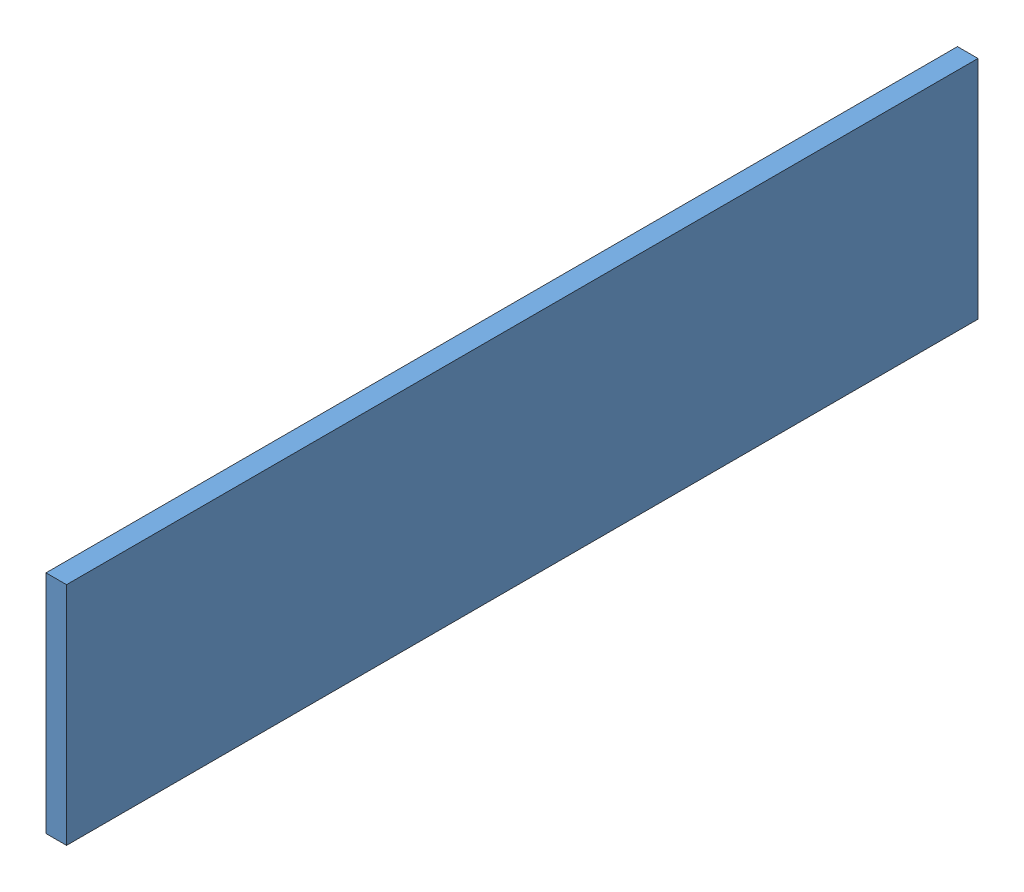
SolidWorks assembly Baugruppe.SLDASM, configuration l sollte 111mm sein (file format 3400). Lengths in mm.
Overall size (5 55 222).
2 component instances, 1 part files, 0 mates.
Components (placement in the parent):
- UB-1: UB.SLDASM [l=111mm] at (25.8178 72.534 -98.34) size (5 55 222)
  - Teil_mit_Referenzen-1: Teil_mit_Referenzen.SLDPRT [Zeichnung] x (0 0 -1) z (1 0 0) size (222 55 5)
